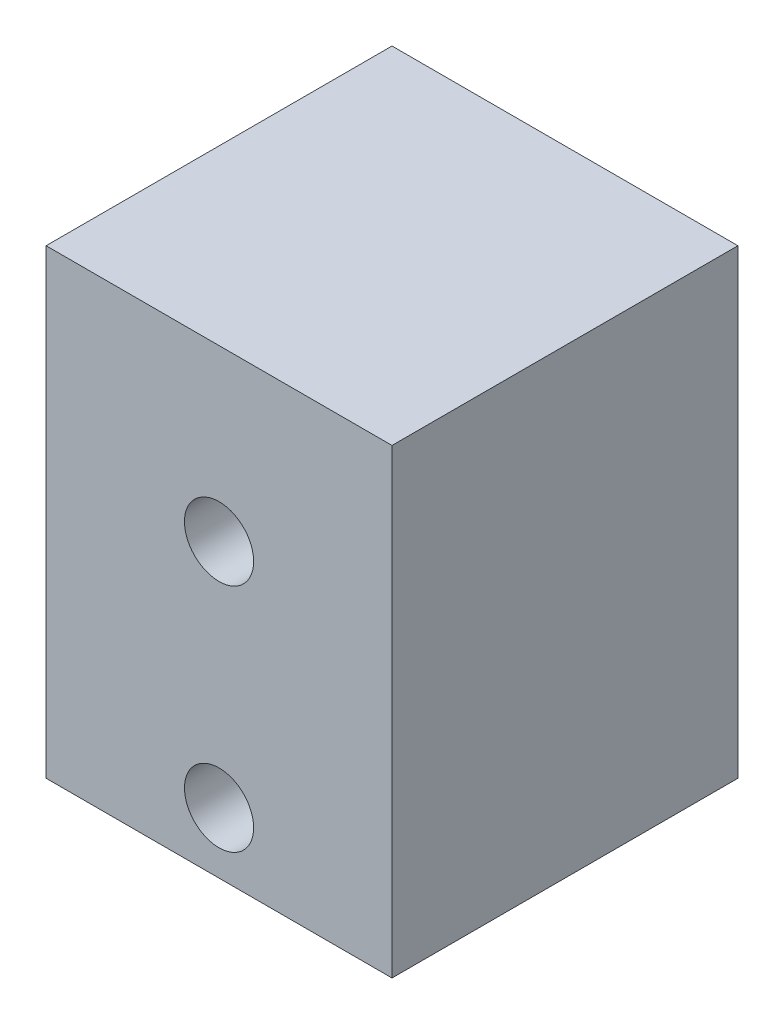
ISO-10303-21;
HEADER;
FILE_DESCRIPTION(('STEP AP214'),'2;1');
FILE_NAME('part.step','',(''),(''),'','','');
FILE_SCHEMA(('AUTOMOTIVE_DESIGN { 1 0 10303 214 1 1 1 1 }'));
ENDSEC;
DATA;
#1=APPLICATION_CONTEXT('core data for automotive mechanical design processes');
#2=APPLICATION_PROTOCOL_DEFINITION('international standard','automotive_design',2000,#1);
#3=PRODUCT_CONTEXT('',#1,'mechanical');
#4=PRODUCT('Part','Part','',(#3));
#5=PRODUCT_RELATED_PRODUCT_CATEGORY('part','',(#4));
#6=PRODUCT_DEFINITION_FORMATION('','',#4);
#7=PRODUCT_DEFINITION_CONTEXT('part definition',#1,'design');
#8=PRODUCT_DEFINITION('design','',#6,#7);
#9=PRODUCT_DEFINITION_SHAPE('','',#8);
#10=(LENGTH_UNIT() NAMED_UNIT(*) SI_UNIT(.MILLI.,.METRE.));
#11=(NAMED_UNIT(*) PLANE_ANGLE_UNIT() SI_UNIT($,.RADIAN.));
#12=(NAMED_UNIT(*) SI_UNIT($,.STERADIAN.) SOLID_ANGLE_UNIT());
#13=UNCERTAINTY_MEASURE_WITH_UNIT(LENGTH_MEASURE(1.E-05),#10,'distance_accuracy_value','');
#14=(GEOMETRIC_REPRESENTATION_CONTEXT(3) GLOBAL_UNCERTAINTY_ASSIGNED_CONTEXT((#13)) GLOBAL_UNIT_ASSIGNED_CONTEXT((#10,
#11,#12)) REPRESENTATION_CONTEXT('',''));
#15=CARTESIAN_POINT('',(0.,0.,0.));
#16=DIRECTION('',(0.,0.,1.));
#17=DIRECTION('',(1.,0.,0.));
#18=AXIS2_PLACEMENT_3D('',#15,#16,#17);
#19=CARTESIAN_POINT('',(0.,40.,30.));
#20=DIRECTION('',(0.,0.,-1.));
#21=DIRECTION('',(-1.,0.,0.));
#22=AXIS2_PLACEMENT_3D('',#19,#20,#21);
#23=PLANE('',#22);
#24=CARTESIAN_POINT('',(15.,5.28054955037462,30.));
#25=DIRECTION('',(0.,0.,1.));
#26=DIRECTION('',(1.,0.,0.));
#27=AXIS2_PLACEMENT_3D('',#24,#25,#26);
#28=CIRCLE('',#27,3.);
#29=CARTESIAN_POINT('',(18.,5.28054955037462,30.));
#30=VERTEX_POINT('',#29);
#31=EDGE_CURVE('E100',#30,#30,#28,.T.);
#32=ORIENTED_EDGE('',*,*,#31,.F.);
#33=EDGE_LOOP('',(#32));
#34=FACE_BOUND('',#33,.T.);
#35=DIRECTION('',(0.,-1.,0.));
#36=VECTOR('',#35,1.);
#37=CARTESIAN_POINT('',(0.,0.,30.));
#38=LINE('',#37,#36);
#39=CARTESIAN_POINT('',(0.,40.,30.));
#40=VERTEX_POINT('',#39);
#41=CARTESIAN_POINT('',(0.,0.,30.));
#42=VERTEX_POINT('',#41);
#43=EDGE_CURVE('E85',#40,#42,#38,.T.);
#44=ORIENTED_EDGE('',*,*,#43,.T.);
#45=DIRECTION('',(1.,0.,0.));
#46=VECTOR('',#45,1.);
#47=CARTESIAN_POINT('',(0.,0.,30.));
#48=LINE('',#47,#46);
#49=CARTESIAN_POINT('',(30.,0.,30.));
#50=VERTEX_POINT('',#49);
#51=EDGE_CURVE('E80',#42,#50,#48,.T.);
#52=ORIENTED_EDGE('',*,*,#51,.T.);
#53=DIRECTION('',(0.,1.,0.));
#54=VECTOR('',#53,1.);
#55=CARTESIAN_POINT('',(30.,0.,30.));
#56=LINE('',#55,#54);
#57=CARTESIAN_POINT('',(30.,40.,30.));
#58=VERTEX_POINT('',#57);
#59=EDGE_CURVE('E83',#50,#58,#56,.T.);
#60=ORIENTED_EDGE('',*,*,#59,.T.);
#61=DIRECTION('',(-1.,0.,0.));
#62=VECTOR('',#61,1.);
#63=CARTESIAN_POINT('',(0.,40.,30.));
#64=LINE('',#63,#62);
#65=EDGE_CURVE('E50',#58,#40,#64,.T.);
#66=ORIENTED_EDGE('',*,*,#65,.T.);
#67=EDGE_LOOP('',(#44,#52,#60,#66));
#68=FACE_BOUND('',#67,.T.);
#69=CARTESIAN_POINT('',(15.,25.2805495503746,30.));
#70=DIRECTION('',(0.,0.,1.));
#71=DIRECTION('',(1.,0.,0.));
#72=AXIS2_PLACEMENT_3D('',#69,#70,#71);
#73=CIRCLE('',#72,3.);
#74=CARTESIAN_POINT('',(18.,25.2805495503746,30.));
#75=VERTEX_POINT('',#74);
#76=EDGE_CURVE('E115',#75,#75,#73,.T.);
#77=ORIENTED_EDGE('',*,*,#76,.F.);
#78=EDGE_LOOP('',(#77));
#79=FACE_BOUND('',#78,.T.);
#80=ADVANCED_FACE('F33',(#34,#68,#79),#23,.F.);
#81=CARTESIAN_POINT('',(0.,40.,0.));
#82=DIRECTION('',(0.,0.,-1.));
#83=DIRECTION('',(-1.,0.,0.));
#84=AXIS2_PLACEMENT_3D('',#81,#82,#83);
#85=PLANE('',#84);
#86=CARTESIAN_POINT('',(15.,5.28054955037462,0.));
#87=DIRECTION('',(0.,0.,1.));
#88=DIRECTION('',(1.,0.,0.));
#89=AXIS2_PLACEMENT_3D('',#86,#87,#88);
#90=CIRCLE('',#89,3.);
#91=CARTESIAN_POINT('',(18.,5.28054955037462,0.));
#92=VERTEX_POINT('',#91);
#93=EDGE_CURVE('E112',#92,#92,#90,.T.);
#94=ORIENTED_EDGE('',*,*,#93,.T.);
#95=EDGE_LOOP('',(#94));
#96=FACE_BOUND('',#95,.T.);
#97=DIRECTION('',(0.,-1.,0.));
#98=VECTOR('',#97,1.);
#99=CARTESIAN_POINT('',(0.,0.,0.));
#100=LINE('',#99,#98);
#101=CARTESIAN_POINT('',(0.,40.,0.));
#102=VERTEX_POINT('',#101);
#103=CARTESIAN_POINT('',(0.,0.,0.));
#104=VERTEX_POINT('',#103);
#105=EDGE_CURVE('E97',#102,#104,#100,.T.);
#106=ORIENTED_EDGE('',*,*,#105,.F.);
#107=DIRECTION('',(-1.,0.,0.));
#108=VECTOR('',#107,1.);
#109=CARTESIAN_POINT('',(0.,40.,0.));
#110=LINE('',#109,#108);
#111=CARTESIAN_POINT('',(30.,40.,0.));
#112=VERTEX_POINT('',#111);
#113=EDGE_CURVE('E73',#112,#102,#110,.T.);
#114=ORIENTED_EDGE('',*,*,#113,.F.);
#115=DIRECTION('',(0.,1.,0.));
#116=VECTOR('',#115,1.);
#117=CARTESIAN_POINT('',(30.,0.,0.));
#118=LINE('',#117,#116);
#119=CARTESIAN_POINT('',(30.,0.,0.));
#120=VERTEX_POINT('',#119);
#121=EDGE_CURVE('E67',#120,#112,#118,.T.);
#122=ORIENTED_EDGE('',*,*,#121,.F.);
#123=DIRECTION('',(1.,0.,0.));
#124=VECTOR('',#123,1.);
#125=CARTESIAN_POINT('',(0.,0.,0.));
#126=LINE('',#125,#124);
#127=EDGE_CURVE('E89',#104,#120,#126,.T.);
#128=ORIENTED_EDGE('',*,*,#127,.F.);
#129=EDGE_LOOP('',(#106,#114,#122,#128));
#130=FACE_BOUND('',#129,.T.);
#131=CARTESIAN_POINT('',(15.,25.2805495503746,0.));
#132=DIRECTION('',(0.,0.,1.));
#133=DIRECTION('',(1.,0.,0.));
#134=AXIS2_PLACEMENT_3D('',#131,#132,#133);
#135=CIRCLE('',#134,3.);
#136=CARTESIAN_POINT('',(18.,25.2805495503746,0.));
#137=VERTEX_POINT('',#136);
#138=EDGE_CURVE('E118',#137,#137,#135,.T.);
#139=ORIENTED_EDGE('',*,*,#138,.T.);
#140=EDGE_LOOP('',(#139));
#141=FACE_BOUND('',#140,.T.);
#142=ADVANCED_FACE('F108',(#96,#130,#141),#85,.T.);
#143=CARTESIAN_POINT('',(0.,0.,30.));
#144=DIRECTION('',(1.,0.,0.));
#145=DIRECTION('',(0.,0.,-1.));
#146=AXIS2_PLACEMENT_3D('',#143,#144,#145);
#147=PLANE('',#146);
#148=ORIENTED_EDGE('',*,*,#105,.T.);
#149=DIRECTION('',(0.,0.,-1.));
#150=VECTOR('',#149,1.);
#151=CARTESIAN_POINT('',(0.,0.,30.));
#152=LINE('',#151,#150);
#153=EDGE_CURVE('E11',#42,#104,#152,.T.);
#154=ORIENTED_EDGE('',*,*,#153,.F.);
#155=ORIENTED_EDGE('',*,*,#43,.F.);
#156=DIRECTION('',(0.,0.,-1.));
#157=VECTOR('',#156,1.);
#158=CARTESIAN_POINT('',(0.,40.,30.));
#159=LINE('',#158,#157);
#160=EDGE_CURVE('E93',#40,#102,#159,.T.);
#161=ORIENTED_EDGE('',*,*,#160,.T.);
#162=EDGE_LOOP('',(#148,#154,#155,#161));
#163=FACE_BOUND('',#162,.T.);
#164=ADVANCED_FACE('F35',(#163),#147,.F.);
#165=CARTESIAN_POINT('',(0.,0.,30.));
#166=DIRECTION('',(0.,1.,0.));
#167=DIRECTION('',(0.,0.,1.));
#168=AXIS2_PLACEMENT_3D('',#165,#166,#167);
#169=PLANE('',#168);
#170=ORIENTED_EDGE('',*,*,#127,.T.);
#171=DIRECTION('',(0.,0.,-1.));
#172=VECTOR('',#171,1.);
#173=CARTESIAN_POINT('',(30.,0.,30.));
#174=LINE('',#173,#172);
#175=EDGE_CURVE('E42',#50,#120,#174,.T.);
#176=ORIENTED_EDGE('',*,*,#175,.F.);
#177=ORIENTED_EDGE('',*,*,#51,.F.);
#178=ORIENTED_EDGE('',*,*,#153,.T.);
#179=EDGE_LOOP('',(#170,#176,#177,#178));
#180=FACE_BOUND('',#179,.T.);
#181=ADVANCED_FACE('F88',(#180),#169,.F.);
#182=CARTESIAN_POINT('',(30.,0.,30.));
#183=DIRECTION('',(-1.,0.,0.));
#184=DIRECTION('',(0.,0.,1.));
#185=AXIS2_PLACEMENT_3D('',#182,#183,#184);
#186=PLANE('',#185);
#187=ORIENTED_EDGE('',*,*,#121,.T.);
#188=DIRECTION('',(0.,0.,-1.));
#189=VECTOR('',#188,1.);
#190=CARTESIAN_POINT('',(30.,40.,30.));
#191=LINE('',#190,#189);
#192=EDGE_CURVE('E90',#58,#112,#191,.T.);
#193=ORIENTED_EDGE('',*,*,#192,.F.);
#194=ORIENTED_EDGE('',*,*,#59,.F.);
#195=ORIENTED_EDGE('',*,*,#175,.T.);
#196=EDGE_LOOP('',(#187,#193,#194,#195));
#197=FACE_BOUND('',#196,.T.);
#198=ADVANCED_FACE('F91',(#197),#186,.F.);
#199=CARTESIAN_POINT('',(0.,40.,30.));
#200=DIRECTION('',(0.,-1.,0.));
#201=DIRECTION('',(0.,0.,-1.));
#202=AXIS2_PLACEMENT_3D('',#199,#200,#201);
#203=PLANE('',#202);
#204=ORIENTED_EDGE('',*,*,#113,.T.);
#205=ORIENTED_EDGE('',*,*,#160,.F.);
#206=ORIENTED_EDGE('',*,*,#65,.F.);
#207=ORIENTED_EDGE('',*,*,#192,.T.);
#208=EDGE_LOOP('',(#204,#205,#206,#207));
#209=FACE_BOUND('',#208,.T.);
#210=ADVANCED_FACE('F105',(#209),#203,.F.);
#211=CARTESIAN_POINT('',(15.,5.28054955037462,30.));
#212=DIRECTION('',(0.,0.,-1.));
#213=DIRECTION('',(-1.,0.,0.));
#214=AXIS2_PLACEMENT_3D('',#211,#212,#213);
#215=CYLINDRICAL_SURFACE('',#214,3.);
#216=ORIENTED_EDGE('',*,*,#31,.T.);
#217=EDGE_LOOP('',(#216));
#218=FACE_BOUND('',#217,.T.);
#219=ORIENTED_EDGE('',*,*,#93,.F.);
#220=EDGE_LOOP('',(#219));
#221=FACE_BOUND('',#220,.T.);
#222=ADVANCED_FACE('F136',(#218,#221),#215,.F.);
#223=CARTESIAN_POINT('',(15.,25.2805495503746,30.));
#224=DIRECTION('',(0.,0.,-1.));
#225=DIRECTION('',(-1.,0.,0.));
#226=AXIS2_PLACEMENT_3D('',#223,#224,#225);
#227=CYLINDRICAL_SURFACE('',#226,3.);
#228=ORIENTED_EDGE('',*,*,#76,.T.);
#229=EDGE_LOOP('',(#228));
#230=FACE_BOUND('',#229,.T.);
#231=ORIENTED_EDGE('',*,*,#138,.F.);
#232=EDGE_LOOP('',(#231));
#233=FACE_BOUND('',#232,.T.);
#234=ADVANCED_FACE('F124',(#230,#233),#227,.F.);
#235=CLOSED_SHELL('',(#80,#142,#164,#181,#198,#210,#222,#234));
#236=MANIFOLD_SOLID_BREP('B2',#235);
#237=ADVANCED_BREP_SHAPE_REPRESENTATION('',(#18,#236),#14);
#238=SHAPE_DEFINITION_REPRESENTATION(#9,#237);
ENDSEC;
END-ISO-10303-21;
